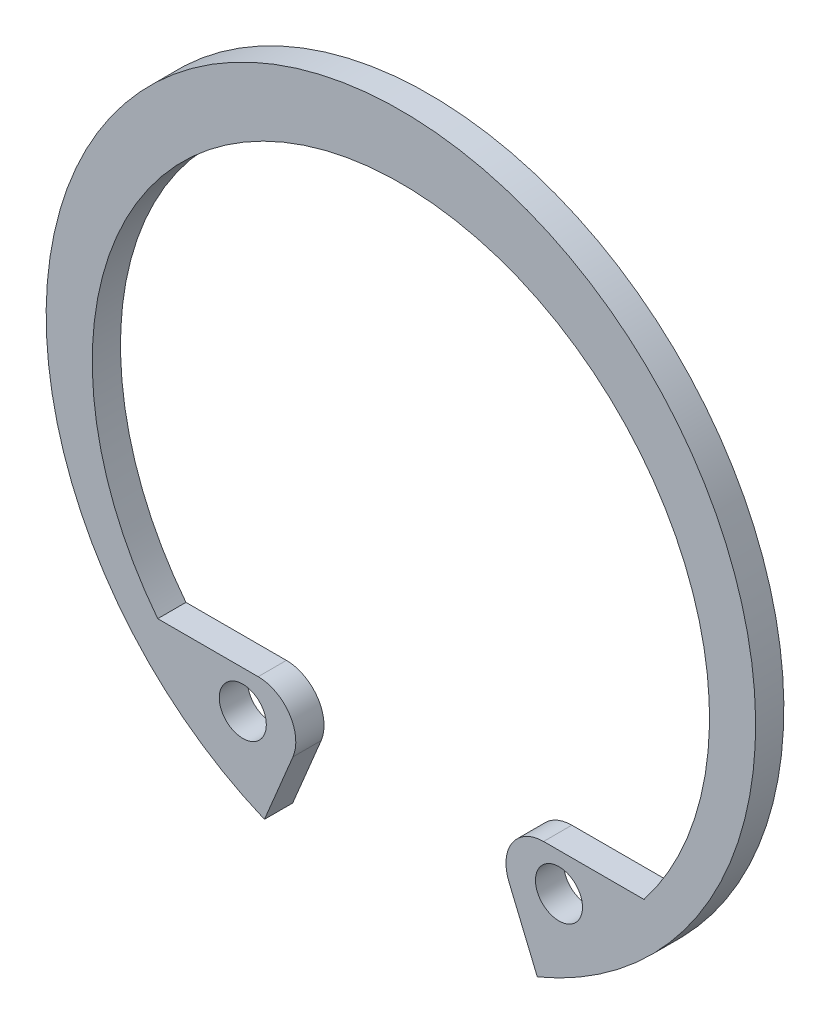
from build123d import *

# Parameters (mm, degrees)
ESQUISSE1_R      = 1.25
EXTRUSION1_DEPTH = 1.5


with BuildPart() as part:
    # Esquisse1 → Extrusion1 (new body)
    with BuildSketch(Plane.XY):
        with BuildLine():
            Line((-12.92091328, -11), (-7.583333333, -11))
            ThreePointArc((-7.583333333, -11), (-5.919232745, -11.890599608), (-5.737179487, -13.769230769))
            Line((-5.737179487, -13.769230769), (-7.25, -17.4))
            ThreePointArc((-7.25, -17.4), (0, 18.85), (7.25, -17.4))
            Line((7.25, -17.4), (5.737179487, -13.769230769))
            ThreePointArc((5.737179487, -13.769230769), (5.919232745, -11.890599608), (7.583333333, -11))
            Line((7.583333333, -11), (12.92091328, -11))
            ThreePointArc((12.92091328, -11), (0, 15.5), (-12.92091328, -11))
        make_face()
        with Locations((8.4, -13)):
            Circle(ESQUISSE1_R, mode=Mode.SUBTRACT)
        with Locations((-8.4, -13)):
            Circle(ESQUISSE1_R, mode=Mode.SUBTRACT)
    extrude(amount=EXTRUSION1_DEPTH)


solid = part.part
